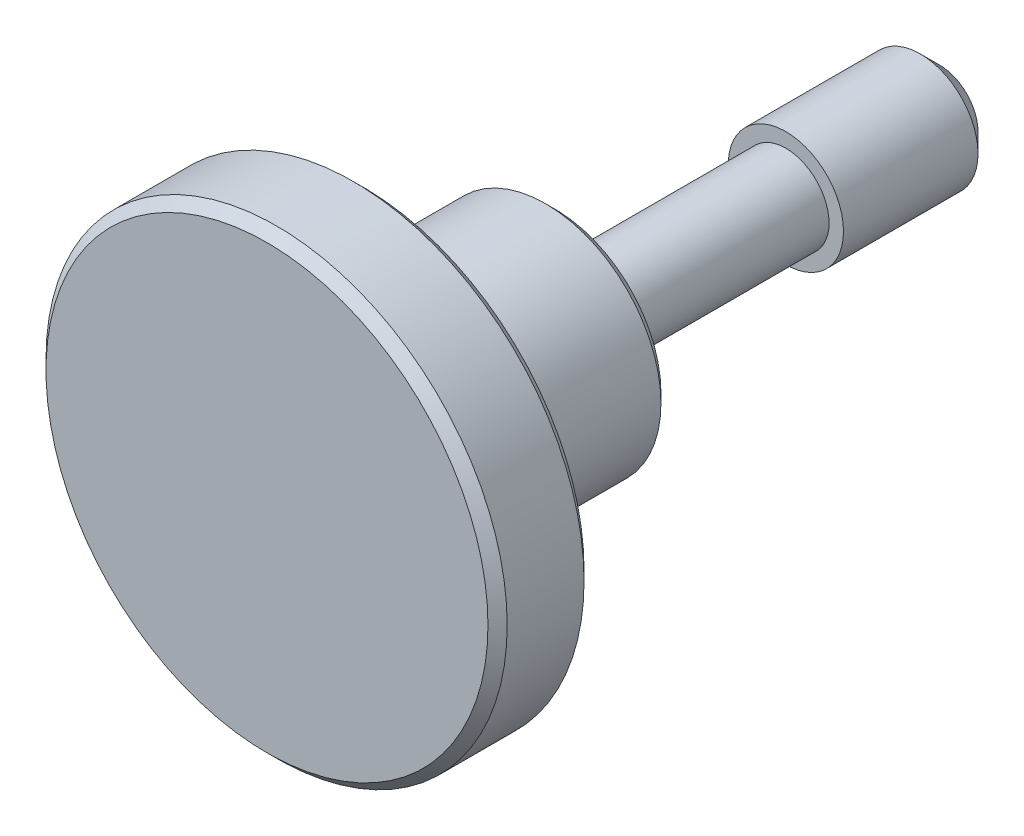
ISO-10303-21;
HEADER;
FILE_DESCRIPTION(('STEP AP214'),'2;1');
FILE_NAME('part.step','',(''),(''),'','','');
FILE_SCHEMA(('AUTOMOTIVE_DESIGN { 1 0 10303 214 1 1 1 1 }'));
ENDSEC;
DATA;
#1=APPLICATION_CONTEXT('core data for automotive mechanical design processes');
#2=APPLICATION_PROTOCOL_DEFINITION('international standard','automotive_design',2000,#1);
#3=PRODUCT_CONTEXT('',#1,'mechanical');
#4=PRODUCT('Part','Part','',(#3));
#5=PRODUCT_RELATED_PRODUCT_CATEGORY('part','',(#4));
#6=PRODUCT_DEFINITION_FORMATION('','',#4);
#7=PRODUCT_DEFINITION_CONTEXT('part definition',#1,'design');
#8=PRODUCT_DEFINITION('design','',#6,#7);
#9=PRODUCT_DEFINITION_SHAPE('','',#8);
#10=(LENGTH_UNIT() NAMED_UNIT(*) SI_UNIT(.MILLI.,.METRE.));
#11=(NAMED_UNIT(*) PLANE_ANGLE_UNIT() SI_UNIT($,.RADIAN.));
#12=(NAMED_UNIT(*) SI_UNIT($,.STERADIAN.) SOLID_ANGLE_UNIT());
#13=UNCERTAINTY_MEASURE_WITH_UNIT(LENGTH_MEASURE(1.E-05),#10,'distance_accuracy_value','');
#14=(GEOMETRIC_REPRESENTATION_CONTEXT(3) GLOBAL_UNCERTAINTY_ASSIGNED_CONTEXT((#13)) GLOBAL_UNIT_ASSIGNED_CONTEXT((#10,
#11,#12)) REPRESENTATION_CONTEXT('',''));
#15=CARTESIAN_POINT('',(0.,0.,0.));
#16=DIRECTION('',(0.,0.,1.));
#17=DIRECTION('',(1.,0.,0.));
#18=AXIS2_PLACEMENT_3D('',#15,#16,#17);
#19=CARTESIAN_POINT('',(0.,0.,9.));
#20=DIRECTION('',(0.,0.,1.));
#21=DIRECTION('',(1.,0.,0.));
#22=AXIS2_PLACEMENT_3D('',#19,#20,#21);
#23=TOROIDAL_SURFACE('',#22,7.,1.);
#24=CARTESIAN_POINT('',(0.,0.,10.));
#25=DIRECTION('',(0.,0.,1.));
#26=DIRECTION('',(1.,0.,0.));
#27=AXIS2_PLACEMENT_3D('',#24,#25,#26);
#28=CIRCLE('',#27,7.);
#29=CARTESIAN_POINT('',(7.,0.,10.));
#30=VERTEX_POINT('',#29);
#31=EDGE_CURVE('E8',#30,#30,#28,.T.);
#32=ORIENTED_EDGE('',*,*,#31,.F.);
#33=EDGE_LOOP('',(#32));
#34=FACE_BOUND('',#33,.T.);
#35=CARTESIAN_POINT('',(0.,0.,9.));
#36=DIRECTION('',(0.,0.,1.));
#37=DIRECTION('',(1.,0.,0.));
#38=AXIS2_PLACEMENT_3D('',#35,#36,#37);
#39=CIRCLE('',#38,6.);
#40=CARTESIAN_POINT('',(6.,0.,9.));
#41=VERTEX_POINT('',#40);
#42=EDGE_CURVE('E58',#41,#41,#39,.T.);
#43=ORIENTED_EDGE('',*,*,#42,.T.);
#44=EDGE_LOOP('',(#43));
#45=FACE_BOUND('',#44,.T.);
#46=ADVANCED_FACE('F12',(#34,#45),#23,.F.);
#47=CARTESIAN_POINT('',(0.,11.5,10.));
#48=DIRECTION('',(0.,0.,1.));
#49=DIRECTION('',(1.,0.,0.));
#50=AXIS2_PLACEMENT_3D('',#47,#48,#49);
#51=PLANE('',#50);
#52=CARTESIAN_POINT('',(0.,0.,10.));
#53=DIRECTION('',(0.,0.,1.));
#54=DIRECTION('',(1.,0.,0.));
#55=AXIS2_PLACEMENT_3D('',#52,#53,#54);
#56=CIRCLE('',#55,11.5);
#57=CARTESIAN_POINT('',(11.5,0.,10.));
#58=VERTEX_POINT('',#57);
#59=EDGE_CURVE('E18',#58,#58,#56,.T.);
#60=ORIENTED_EDGE('',*,*,#59,.F.);
#61=EDGE_LOOP('',(#60));
#62=FACE_BOUND('',#61,.T.);
#63=ORIENTED_EDGE('',*,*,#31,.T.);
#64=EDGE_LOOP('',(#63));
#65=FACE_BOUND('',#64,.T.);
#66=ADVANCED_FACE('F124',(#62,#65),#51,.F.);
#67=CARTESIAN_POINT('',(0.,0.,10.));
#68=DIRECTION('',(0.,0.,1.));
#69=DIRECTION('',(1.,0.,0.));
#70=AXIS2_PLACEMENT_3D('',#67,#68,#69);
#71=CONICAL_SURFACE('',#70,11.5,0.785398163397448);
#72=CARTESIAN_POINT('',(0.,0.,10.5));
#73=DIRECTION('',(0.,0.,1.));
#74=DIRECTION('',(1.,0.,0.));
#75=AXIS2_PLACEMENT_3D('',#72,#73,#74);
#76=CIRCLE('',#75,12.);
#77=CARTESIAN_POINT('',(12.,0.,10.5));
#78=VERTEX_POINT('',#77);
#79=EDGE_CURVE('E22',#78,#78,#76,.T.);
#80=ORIENTED_EDGE('',*,*,#79,.F.);
#81=EDGE_LOOP('',(#80));
#82=FACE_BOUND('',#81,.T.);
#83=ORIENTED_EDGE('',*,*,#59,.T.);
#84=EDGE_LOOP('',(#83));
#85=FACE_BOUND('',#84,.T.);
#86=ADVANCED_FACE('F130',(#82,#85),#71,.T.);
#87=CARTESIAN_POINT('',(0.,0.,15.));
#88=DIRECTION('',(0.,0.,1.));
#89=DIRECTION('',(1.,0.,0.));
#90=AXIS2_PLACEMENT_3D('',#87,#88,#89);
#91=CYLINDRICAL_SURFACE('',#90,12.);
#92=CARTESIAN_POINT('',(0.,0.,14.5));
#93=DIRECTION('',(0.,0.,1.));
#94=DIRECTION('',(1.,0.,0.));
#95=AXIS2_PLACEMENT_3D('',#92,#93,#94);
#96=CIRCLE('',#95,12.);
#97=CARTESIAN_POINT('',(12.,0.,14.5));
#98=VERTEX_POINT('',#97);
#99=EDGE_CURVE('E26',#98,#98,#96,.T.);
#100=ORIENTED_EDGE('',*,*,#99,.F.);
#101=EDGE_LOOP('',(#100));
#102=FACE_BOUND('',#101,.T.);
#103=ORIENTED_EDGE('',*,*,#79,.T.);
#104=EDGE_LOOP('',(#103));
#105=FACE_BOUND('',#104,.T.);
#106=ADVANCED_FACE('F136',(#102,#105),#91,.T.);
#107=CARTESIAN_POINT('',(0.,0.,14.5));
#108=DIRECTION('',(0.,0.,-1.));
#109=DIRECTION('',(-1.,0.,0.));
#110=AXIS2_PLACEMENT_3D('',#107,#108,#109);
#111=CONICAL_SURFACE('',#110,12.,0.785398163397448);
#112=CARTESIAN_POINT('',(0.,0.,15.));
#113=DIRECTION('',(0.,0.,1.));
#114=DIRECTION('',(1.,0.,0.));
#115=AXIS2_PLACEMENT_3D('',#112,#113,#114);
#116=CIRCLE('',#115,11.5);
#117=CARTESIAN_POINT('',(11.5,0.,15.));
#118=VERTEX_POINT('',#117);
#119=EDGE_CURVE('E31',#118,#118,#116,.T.);
#120=ORIENTED_EDGE('',*,*,#119,.F.);
#121=EDGE_LOOP('',(#120));
#122=FACE_BOUND('',#121,.T.);
#123=ORIENTED_EDGE('',*,*,#99,.T.);
#124=EDGE_LOOP('',(#123));
#125=FACE_BOUND('',#124,.T.);
#126=ADVANCED_FACE('F120',(#122,#125),#111,.T.);
#127=CARTESIAN_POINT('',(0.,11.5,15.));
#128=DIRECTION('',(0.,0.,-1.));
#129=DIRECTION('',(-1.,0.,0.));
#130=AXIS2_PLACEMENT_3D('',#127,#128,#129);
#131=PLANE('',#130);
#132=ORIENTED_EDGE('',*,*,#119,.T.);
#133=EDGE_LOOP('',(#132));
#134=FACE_BOUND('',#133,.T.);
#135=ADVANCED_FACE('F113',(#134),#131,.F.);
#136=CARTESIAN_POINT('',(0.,2.,-20.));
#137=DIRECTION('',(0.,0.,1.));
#138=DIRECTION('',(1.,0.,0.));
#139=AXIS2_PLACEMENT_3D('',#136,#137,#138);
#140=PLANE('',#139);
#141=CARTESIAN_POINT('',(0.,0.,-20.));
#142=DIRECTION('',(0.,0.,1.));
#143=DIRECTION('',(1.,0.,0.));
#144=AXIS2_PLACEMENT_3D('',#141,#142,#143);
#145=CIRCLE('',#144,2.);
#146=CARTESIAN_POINT('',(2.,0.,-20.));
#147=VERTEX_POINT('',#146);
#148=EDGE_CURVE('E34',#147,#147,#145,.T.);
#149=ORIENTED_EDGE('',*,*,#148,.F.);
#150=EDGE_LOOP('',(#149));
#151=FACE_BOUND('',#150,.T.);
#152=ADVANCED_FACE('F108',(#151),#140,.F.);
#153=CARTESIAN_POINT('',(0.,0.,-20.));
#154=DIRECTION('',(0.,0.,1.));
#155=DIRECTION('',(1.,0.,0.));
#156=AXIS2_PLACEMENT_3D('',#153,#154,#155);
#157=CONICAL_SURFACE('',#156,2.,0.785398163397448);
#158=CARTESIAN_POINT('',(0.,0.,-19.));
#159=DIRECTION('',(0.,0.,1.));
#160=DIRECTION('',(1.,0.,0.));
#161=AXIS2_PLACEMENT_3D('',#158,#159,#160);
#162=CIRCLE('',#161,3.);
#163=CARTESIAN_POINT('',(3.,0.,-19.));
#164=VERTEX_POINT('',#163);
#165=EDGE_CURVE('E37',#164,#164,#162,.T.);
#166=ORIENTED_EDGE('',*,*,#165,.F.);
#167=EDGE_LOOP('',(#166));
#168=FACE_BOUND('',#167,.T.);
#169=ORIENTED_EDGE('',*,*,#148,.T.);
#170=EDGE_LOOP('',(#169));
#171=FACE_BOUND('',#170,.T.);
#172=ADVANCED_FACE('F102',(#168,#171),#157,.T.);
#173=CARTESIAN_POINT('',(0.,0.,15.));
#174=DIRECTION('',(0.,0.,1.));
#175=DIRECTION('',(1.,0.,0.));
#176=AXIS2_PLACEMENT_3D('',#173,#174,#175);
#177=CYLINDRICAL_SURFACE('',#176,3.);
#178=CARTESIAN_POINT('',(0.,0.,-12.));
#179=DIRECTION('',(0.,0.,1.));
#180=DIRECTION('',(1.,0.,0.));
#181=AXIS2_PLACEMENT_3D('',#178,#179,#180);
#182=CIRCLE('',#181,3.);
#183=CARTESIAN_POINT('',(3.,0.,-12.));
#184=VERTEX_POINT('',#183);
#185=EDGE_CURVE('E40',#184,#184,#182,.T.);
#186=ORIENTED_EDGE('',*,*,#185,.F.);
#187=EDGE_LOOP('',(#186));
#188=FACE_BOUND('',#187,.T.);
#189=ORIENTED_EDGE('',*,*,#165,.T.);
#190=EDGE_LOOP('',(#189));
#191=FACE_BOUND('',#190,.T.);
#192=ADVANCED_FACE('F96',(#188,#191),#177,.T.);
#193=CARTESIAN_POINT('',(0.,3.,-12.));
#194=DIRECTION('',(0.,0.,-1.));
#195=DIRECTION('',(-1.,0.,0.));
#196=AXIS2_PLACEMENT_3D('',#193,#194,#195);
#197=PLANE('',#196);
#198=CARTESIAN_POINT('',(0.,0.,-12.));
#199=DIRECTION('',(0.,0.,1.));
#200=DIRECTION('',(1.,0.,0.));
#201=AXIS2_PLACEMENT_3D('',#198,#199,#200);
#202=CIRCLE('',#201,2.25);
#203=CARTESIAN_POINT('',(2.25,0.,-12.));
#204=VERTEX_POINT('',#203);
#205=EDGE_CURVE('E43',#204,#204,#202,.T.);
#206=ORIENTED_EDGE('',*,*,#205,.F.);
#207=EDGE_LOOP('',(#206));
#208=FACE_BOUND('',#207,.T.);
#209=ORIENTED_EDGE('',*,*,#185,.T.);
#210=EDGE_LOOP('',(#209));
#211=FACE_BOUND('',#210,.T.);
#212=ADVANCED_FACE('F90',(#208,#211),#197,.F.);
#213=CARTESIAN_POINT('',(0.,0.,15.));
#214=DIRECTION('',(0.,0.,1.));
#215=DIRECTION('',(1.,0.,0.));
#216=AXIS2_PLACEMENT_3D('',#213,#214,#215);
#217=CYLINDRICAL_SURFACE('',#216,2.25);
#218=CARTESIAN_POINT('',(0.,0.,-0.500000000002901));
#219=DIRECTION('',(0.,0.,1.));
#220=DIRECTION('',(1.,0.,0.));
#221=AXIS2_PLACEMENT_3D('',#218,#219,#220);
#222=CIRCLE('',#221,2.25);
#223=CARTESIAN_POINT('',(2.25,0.,-0.500000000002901));
#224=VERTEX_POINT('',#223);
#225=EDGE_CURVE('E46',#224,#224,#222,.T.);
#226=ORIENTED_EDGE('',*,*,#225,.F.);
#227=EDGE_LOOP('',(#226));
#228=FACE_BOUND('',#227,.T.);
#229=ORIENTED_EDGE('',*,*,#205,.T.);
#230=EDGE_LOOP('',(#229));
#231=FACE_BOUND('',#230,.T.);
#232=ADVANCED_FACE('F84',(#228,#231),#217,.T.);
#233=CARTESIAN_POINT('',(0.,0.,-0.5));
#234=DIRECTION('',(0.,0.,1.));
#235=DIRECTION('',(1.,0.,0.));
#236=AXIS2_PLACEMENT_3D('',#233,#234,#235);
#237=TOROIDAL_SURFACE('',#236,2.75,0.5);
#238=CARTESIAN_POINT('',(0.,0.,0.));
#239=DIRECTION('',(0.,0.,1.));
#240=DIRECTION('',(1.,0.,0.));
#241=AXIS2_PLACEMENT_3D('',#238,#239,#240);
#242=CIRCLE('',#241,2.75);
#243=CARTESIAN_POINT('',(2.75,0.,0.));
#244=VERTEX_POINT('',#243);
#245=EDGE_CURVE('E49',#244,#244,#242,.T.);
#246=ORIENTED_EDGE('',*,*,#245,.F.);
#247=EDGE_LOOP('',(#246));
#248=FACE_BOUND('',#247,.T.);
#249=ORIENTED_EDGE('',*,*,#225,.T.);
#250=EDGE_LOOP('',(#249));
#251=FACE_BOUND('',#250,.T.);
#252=ADVANCED_FACE('F78',(#248,#251),#237,.F.);
#253=CARTESIAN_POINT('',(0.,5.5,0.));
#254=DIRECTION('',(0.,0.,1.));
#255=DIRECTION('',(1.,0.,0.));
#256=AXIS2_PLACEMENT_3D('',#253,#254,#255);
#257=PLANE('',#256);
#258=CARTESIAN_POINT('',(0.,0.,0.));
#259=DIRECTION('',(0.,0.,1.));
#260=DIRECTION('',(1.,0.,0.));
#261=AXIS2_PLACEMENT_3D('',#258,#259,#260);
#262=CIRCLE('',#261,5.5);
#263=CARTESIAN_POINT('',(5.5,0.,0.));
#264=VERTEX_POINT('',#263);
#265=EDGE_CURVE('E52',#264,#264,#262,.T.);
#266=ORIENTED_EDGE('',*,*,#265,.F.);
#267=EDGE_LOOP('',(#266));
#268=FACE_BOUND('',#267,.T.);
#269=ORIENTED_EDGE('',*,*,#245,.T.);
#270=EDGE_LOOP('',(#269));
#271=FACE_BOUND('',#270,.T.);
#272=ADVANCED_FACE('F72',(#268,#271),#257,.F.);
#273=CARTESIAN_POINT('',(0.,0.,0.));
#274=DIRECTION('',(0.,0.,1.));
#275=DIRECTION('',(1.,0.,0.));
#276=AXIS2_PLACEMENT_3D('',#273,#274,#275);
#277=CONICAL_SURFACE('',#276,5.5,0.785398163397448);
#278=CARTESIAN_POINT('',(0.,0.,0.5));
#279=DIRECTION('',(0.,0.,1.));
#280=DIRECTION('',(1.,0.,0.));
#281=AXIS2_PLACEMENT_3D('',#278,#279,#280);
#282=CIRCLE('',#281,6.);
#283=CARTESIAN_POINT('',(6.,0.,0.5));
#284=VERTEX_POINT('',#283);
#285=EDGE_CURVE('E55',#284,#284,#282,.T.);
#286=ORIENTED_EDGE('',*,*,#285,.F.);
#287=EDGE_LOOP('',(#286));
#288=FACE_BOUND('',#287,.T.);
#289=ORIENTED_EDGE('',*,*,#265,.T.);
#290=EDGE_LOOP('',(#289));
#291=FACE_BOUND('',#290,.T.);
#292=ADVANCED_FACE('F66',(#288,#291),#277,.T.);
#293=CARTESIAN_POINT('',(0.,0.,15.));
#294=DIRECTION('',(0.,0.,1.));
#295=DIRECTION('',(1.,0.,0.));
#296=AXIS2_PLACEMENT_3D('',#293,#294,#295);
#297=CYLINDRICAL_SURFACE('',#296,6.);
#298=ORIENTED_EDGE('',*,*,#42,.F.);
#299=EDGE_LOOP('',(#298));
#300=FACE_BOUND('',#299,.T.);
#301=ORIENTED_EDGE('',*,*,#285,.T.);
#302=EDGE_LOOP('',(#301));
#303=FACE_BOUND('',#302,.T.);
#304=ADVANCED_FACE('F63',(#300,#303),#297,.T.);
#305=CLOSED_SHELL('',(#46,#66,#86,#106,#126,#135,#152,#172,#192,#212,#232,#252,#272,#292,#304));
#306=MANIFOLD_SOLID_BREP('B1',#305);
#307=ADVANCED_BREP_SHAPE_REPRESENTATION('',(#18,#306),#14);
#308=SHAPE_DEFINITION_REPRESENTATION(#9,#307);
ENDSEC;
END-ISO-10303-21;
